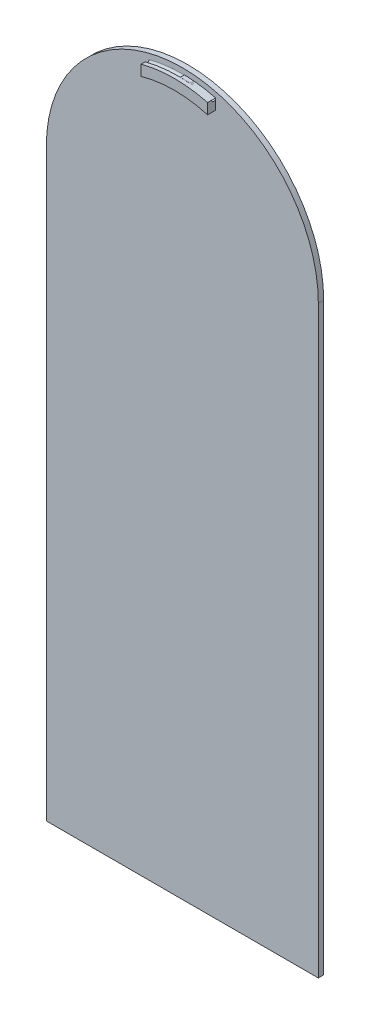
ISO-10303-21;
HEADER;
FILE_DESCRIPTION(('STEP AP214'),'2;1');
FILE_NAME('part.step','',(''),(''),'','','');
FILE_SCHEMA(('AUTOMOTIVE_DESIGN { 1 0 10303 214 1 1 1 1 }'));
ENDSEC;
DATA;
#1=APPLICATION_CONTEXT('core data for automotive mechanical design processes');
#2=APPLICATION_PROTOCOL_DEFINITION('international standard','automotive_design',2000,#1);
#3=PRODUCT_CONTEXT('',#1,'mechanical');
#4=PRODUCT('Part','Part','',(#3));
#5=PRODUCT_RELATED_PRODUCT_CATEGORY('part','',(#4));
#6=PRODUCT_DEFINITION_FORMATION('','',#4);
#7=PRODUCT_DEFINITION_CONTEXT('part definition',#1,'design');
#8=PRODUCT_DEFINITION('design','',#6,#7);
#9=PRODUCT_DEFINITION_SHAPE('','',#8);
#10=(LENGTH_UNIT() NAMED_UNIT(*) SI_UNIT(.MILLI.,.METRE.));
#11=(NAMED_UNIT(*) PLANE_ANGLE_UNIT() SI_UNIT($,.RADIAN.));
#12=(NAMED_UNIT(*) SI_UNIT($,.STERADIAN.) SOLID_ANGLE_UNIT());
#13=UNCERTAINTY_MEASURE_WITH_UNIT(LENGTH_MEASURE(1.E-05),#10,'distance_accuracy_value','');
#14=(GEOMETRIC_REPRESENTATION_CONTEXT(3) GLOBAL_UNCERTAINTY_ASSIGNED_CONTEXT((#13)) GLOBAL_UNIT_ASSIGNED_CONTEXT((#10,
#11,#12)) REPRESENTATION_CONTEXT('',''));
#15=CARTESIAN_POINT('',(0.,0.,0.));
#16=DIRECTION('',(0.,0.,1.));
#17=DIRECTION('',(1.,0.,0.));
#18=AXIS2_PLACEMENT_3D('',#15,#16,#17);
#19=CARTESIAN_POINT('',(0.,219.6,0.));
#20=DIRECTION('',(0.,0.,1.));
#21=DIRECTION('',(1.,0.,0.));
#22=AXIS2_PLACEMENT_3D('',#19,#20,#21);
#23=PLANE('',#22);
#24=CARTESIAN_POINT('',(0.,219.6,0.));
#25=DIRECTION('',(0.,0.,1.));
#26=DIRECTION('',(1.,0.,0.));
#27=AXIS2_PLACEMENT_3D('',#24,#25,#26);
#28=CIRCLE('',#27,51.1);
#29=CARTESIAN_POINT('',(51.1,219.6,0.));
#30=VERTEX_POINT('',#29);
#31=CARTESIAN_POINT('',(-51.1,219.6,0.));
#32=VERTEX_POINT('',#31);
#33=EDGE_CURVE('E486',#30,#32,#28,.T.);
#34=ORIENTED_EDGE('',*,*,#33,.T.);
#35=DIRECTION('',(0.,-1.,0.));
#36=VECTOR('',#35,1.);
#37=CARTESIAN_POINT('',(-51.1,219.6,0.));
#38=LINE('',#37,#36);
#39=CARTESIAN_POINT('',(-51.1,0.,0.));
#40=VERTEX_POINT('',#39);
#41=EDGE_CURVE('E479',#32,#40,#38,.T.);
#42=ORIENTED_EDGE('',*,*,#41,.T.);
#43=DIRECTION('',(1.,0.,0.));
#44=VECTOR('',#43,1.);
#45=CARTESIAN_POINT('',(-51.1,0.,0.));
#46=LINE('',#45,#44);
#47=CARTESIAN_POINT('',(51.1,0.,0.));
#48=VERTEX_POINT('',#47);
#49=EDGE_CURVE('E475',#40,#48,#46,.T.);
#50=ORIENTED_EDGE('',*,*,#49,.T.);
#51=DIRECTION('',(0.,1.,0.));
#52=VECTOR('',#51,1.);
#53=CARTESIAN_POINT('',(51.1,219.6,0.));
#54=LINE('',#53,#52);
#55=EDGE_CURVE('E467',#48,#30,#54,.T.);
#56=ORIENTED_EDGE('',*,*,#55,.T.);
#57=EDGE_LOOP('',(#34,#42,#50,#56));
#58=FACE_BOUND('',#57,.T.);
#59=DIRECTION('',(0.,1.,0.));
#60=VECTOR('',#59,1.);
#61=CARTESIAN_POINT('',(12.5,267.082207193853,0.));
#62=LINE('',#61,#60);
#63=CARTESIAN_POINT('',(12.5,263.082207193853,0.));
#64=VERTEX_POINT('',#63);
#65=CARTESIAN_POINT('',(12.5,267.080654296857,0.));
#66=VERTEX_POINT('',#65);
#67=EDGE_CURVE('E165',#64,#66,#62,.T.);
#68=ORIENTED_EDGE('',*,*,#67,.F.);
#69=CARTESIAN_POINT('',(0.,219.6,0.));
#70=DIRECTION('',(0.,0.,-1.));
#71=DIRECTION('',(-1.,0.,0.));
#72=AXIS2_PLACEMENT_3D('',#69,#70,#71);
#73=CIRCLE('',#72,45.2432574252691);
#74=CARTESIAN_POINT('',(-12.5,263.082207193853,0.));
#75=VERTEX_POINT('',#74);
#76=EDGE_CURVE('E166',#75,#64,#73,.T.);
#77=ORIENTED_EDGE('',*,*,#76,.F.);
#78=DIRECTION('',(0.,-1.,0.));
#79=VECTOR('',#78,1.);
#80=CARTESIAN_POINT('',(-12.5,267.082207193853,0.));
#81=LINE('',#80,#79);
#82=CARTESIAN_POINT('',(-12.5,267.082207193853,0.));
#83=VERTEX_POINT('',#82);
#84=EDGE_CURVE('E146',#83,#75,#81,.T.);
#85=ORIENTED_EDGE('',*,*,#84,.F.);
#86=CARTESIAN_POINT('',(13.885689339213,266.69765545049,0.));
#87=CARTESIAN_POINT('',(9.67257241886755,267.921243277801,-2.60801907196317E-12));
#88=CARTESIAN_POINT('',(5.22661873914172,268.625570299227,0.));
#89=CARTESIAN_POINT('',(-3.71976148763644,268.762867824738,0.));
#90=CARTESIAN_POINT('',(-8.21225986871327,268.210982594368,-1.64818926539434E-12));
#91=CARTESIAN_POINT('',(-12.8376519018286,266.993318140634,1.29791970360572E-13));
#92=CARTESIAN_POINT('',(-13.1779582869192,266.899832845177,-1.76420335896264E-13));
#93=CARTESIAN_POINT('',(-13.5145310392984,266.804264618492,0.));
#94=B_SPLINE_CURVE_WITH_KNOTS('',3,(#86,#87,#88,#89,#90,#91,#92,#93),.UNSPECIFIED.,.F.,.F.,(4,2,
2,4),(0.,0.481058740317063,0.962117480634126,1.),.UNSPECIFIED.);
#95=CARTESIAN_POINT('',(0.753019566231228,268.694225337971,0.));
#96=VERTEX_POINT('',#95);
#97=EDGE_CURVE('E111',#96,#83,#94,.T.);
#98=ORIENTED_EDGE('',*,*,#97,.F.);
#99=CARTESIAN_POINT('',(0.,219.6,0.));
#100=DIRECTION('',(0.,0.,1.));
#101=DIRECTION('',(-1.,0.,0.));
#102=AXIS2_PLACEMENT_3D('',#99,#100,#101);
#103=CIRCLE('',#102,49.1);
#104=EDGE_CURVE('E139',#66,#96,#103,.T.);
#105=ORIENTED_EDGE('',*,*,#104,.F.);
#106=EDGE_LOOP('',(#68,#77,#85,#98,#105));
#107=FACE_BOUND('',#106,.T.);
#108=ADVANCED_FACE('F33',(#58,#107),#23,.T.);
#109=CARTESIAN_POINT('',(0.,219.6,-2.));
#110=DIRECTION('',(0.,0.,1.));
#111=DIRECTION('',(1.,0.,0.));
#112=AXIS2_PLACEMENT_3D('',#109,#110,#111);
#113=CYLINDRICAL_SURFACE('',#112,51.1);
#114=ORIENTED_EDGE('',*,*,#33,.F.);
#115=DIRECTION('',(0.,0.,1.));
#116=VECTOR('',#115,1.);
#117=CARTESIAN_POINT('',(51.1,219.6,-2.));
#118=LINE('',#117,#116);
#119=CARTESIAN_POINT('',(51.1,219.6,-2.));
#120=VERTEX_POINT('',#119);
#121=EDGE_CURVE('E471',#120,#30,#118,.T.);
#122=ORIENTED_EDGE('',*,*,#121,.F.);
#123=CARTESIAN_POINT('',(0.,219.6,-2.));
#124=DIRECTION('',(0.,0.,1.));
#125=DIRECTION('',(1.,0.,0.));
#126=AXIS2_PLACEMENT_3D('',#123,#124,#125);
#127=CIRCLE('',#126,51.1);
#128=CARTESIAN_POINT('',(-51.1,219.6,-2.));
#129=VERTEX_POINT('',#128);
#130=EDGE_CURVE('E474',#120,#129,#127,.T.);
#131=ORIENTED_EDGE('',*,*,#130,.T.);
#132=DIRECTION('',(0.,0.,1.));
#133=VECTOR('',#132,1.);
#134=CARTESIAN_POINT('',(-51.1,219.6,-2.));
#135=LINE('',#134,#133);
#136=EDGE_CURVE('E155',#129,#32,#135,.T.);
#137=ORIENTED_EDGE('',*,*,#136,.T.);
#138=EDGE_LOOP('',(#114,#122,#131,#137));
#139=FACE_BOUND('',#138,.T.);
#140=ADVANCED_FACE('F293',(#139),#113,.T.);
#141=CARTESIAN_POINT('',(51.1,219.6,-2.));
#142=DIRECTION('',(1.,0.,0.));
#143=DIRECTION('',(0.,1.,0.));
#144=AXIS2_PLACEMENT_3D('',#141,#142,#143);
#145=PLANE('',#144);
#146=ORIENTED_EDGE('',*,*,#55,.F.);
#147=DIRECTION('',(0.,0.,1.));
#148=VECTOR('',#147,1.);
#149=CARTESIAN_POINT('',(51.1,0.,-2.));
#150=LINE('',#149,#148);
#151=CARTESIAN_POINT('',(51.1,0.,-2.));
#152=VERTEX_POINT('',#151);
#153=EDGE_CURVE('E469',#152,#48,#150,.T.);
#154=ORIENTED_EDGE('',*,*,#153,.F.);
#155=DIRECTION('',(0.,1.,0.));
#156=VECTOR('',#155,1.);
#157=CARTESIAN_POINT('',(51.1,219.6,-2.));
#158=LINE('',#157,#156);
#159=EDGE_CURVE('E488',#152,#120,#158,.T.);
#160=ORIENTED_EDGE('',*,*,#159,.T.);
#161=ORIENTED_EDGE('',*,*,#121,.T.);
#162=EDGE_LOOP('',(#146,#154,#160,#161));
#163=FACE_BOUND('',#162,.T.);
#164=ADVANCED_FACE('F299',(#163),#145,.T.);
#165=CARTESIAN_POINT('',(-51.1,0.,-2.));
#166=DIRECTION('',(0.,-1.,0.));
#167=DIRECTION('',(0.,0.,-1.));
#168=AXIS2_PLACEMENT_3D('',#165,#166,#167);
#169=PLANE('',#168);
#170=ORIENTED_EDGE('',*,*,#49,.F.);
#171=DIRECTION('',(0.,0.,1.));
#172=VECTOR('',#171,1.);
#173=CARTESIAN_POINT('',(-51.1,0.,-2.));
#174=LINE('',#173,#172);
#175=CARTESIAN_POINT('',(-51.1,0.,-2.));
#176=VERTEX_POINT('',#175);
#177=EDGE_CURVE('E169',#176,#40,#174,.T.);
#178=ORIENTED_EDGE('',*,*,#177,.F.);
#179=DIRECTION('',(1.,0.,0.));
#180=VECTOR('',#179,1.);
#181=CARTESIAN_POINT('',(-51.1,0.,-2.));
#182=LINE('',#181,#180);
#183=EDGE_CURVE('E490',#176,#152,#182,.T.);
#184=ORIENTED_EDGE('',*,*,#183,.T.);
#185=ORIENTED_EDGE('',*,*,#153,.T.);
#186=EDGE_LOOP('',(#170,#178,#184,#185));
#187=FACE_BOUND('',#186,.T.);
#188=ADVANCED_FACE('F434',(#187),#169,.T.);
#189=CARTESIAN_POINT('',(-51.1,219.6,-2.));
#190=DIRECTION('',(-1.,0.,0.));
#191=DIRECTION('',(0.,-1.,0.));
#192=AXIS2_PLACEMENT_3D('',#189,#190,#191);
#193=PLANE('',#192);
#194=ORIENTED_EDGE('',*,*,#41,.F.);
#195=ORIENTED_EDGE('',*,*,#136,.F.);
#196=DIRECTION('',(0.,-1.,0.));
#197=VECTOR('',#196,1.);
#198=CARTESIAN_POINT('',(-51.1,219.6,-2.));
#199=LINE('',#198,#197);
#200=EDGE_CURVE('E492',#129,#176,#199,.T.);
#201=ORIENTED_EDGE('',*,*,#200,.T.);
#202=ORIENTED_EDGE('',*,*,#177,.T.);
#203=EDGE_LOOP('',(#194,#195,#201,#202));
#204=FACE_BOUND('',#203,.T.);
#205=ADVANCED_FACE('F425',(#204),#193,.T.);
#206=CARTESIAN_POINT('',(0.,219.6,-2.));
#207=DIRECTION('',(0.,0.,1.));
#208=DIRECTION('',(1.,0.,0.));
#209=AXIS2_PLACEMENT_3D('',#206,#207,#208);
#210=PLANE('',#209);
#211=ORIENTED_EDGE('',*,*,#130,.F.);
#212=ORIENTED_EDGE('',*,*,#159,.F.);
#213=ORIENTED_EDGE('',*,*,#183,.F.);
#214=ORIENTED_EDGE('',*,*,#200,.F.);
#215=EDGE_LOOP('',(#211,#212,#213,#214));
#216=FACE_BOUND('',#215,.T.);
#217=ADVANCED_FACE('F308',(#216),#210,.F.);
#218=CARTESIAN_POINT('',(0.,219.6,3.));
#219=DIRECTION('',(0.,0.,-1.));
#220=DIRECTION('',(-1.,0.,0.));
#221=AXIS2_PLACEMENT_3D('',#218,#219,#220);
#222=CYLINDRICAL_SURFACE('',#221,45.2432574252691);
#223=ORIENTED_EDGE('',*,*,#76,.T.);
#224=DIRECTION('',(0.,0.,-1.));
#225=VECTOR('',#224,1.);
#226=CARTESIAN_POINT('',(12.5,263.082207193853,3.));
#227=LINE('',#226,#225);
#228=CARTESIAN_POINT('',(12.5,263.082207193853,3.));
#229=VERTEX_POINT('',#228);
#230=EDGE_CURVE('E323',#229,#64,#227,.T.);
#231=ORIENTED_EDGE('',*,*,#230,.F.);
#232=CARTESIAN_POINT('',(0.,219.6,3.));
#233=DIRECTION('',(0.,0.,-1.));
#234=DIRECTION('',(-1.,0.,0.));
#235=AXIS2_PLACEMENT_3D('',#232,#233,#234);
#236=CIRCLE('',#235,45.2432574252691);
#237=CARTESIAN_POINT('',(-12.5,263.082207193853,3.));
#238=VERTEX_POINT('',#237);
#239=EDGE_CURVE('E148',#238,#229,#236,.T.);
#240=ORIENTED_EDGE('',*,*,#239,.F.);
#241=DIRECTION('',(0.,0.,-1.));
#242=VECTOR('',#241,1.);
#243=CARTESIAN_POINT('',(-12.5,263.082207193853,3.));
#244=LINE('',#243,#242);
#245=EDGE_CURVE('E162',#238,#75,#244,.T.);
#246=ORIENTED_EDGE('',*,*,#245,.T.);
#247=EDGE_LOOP('',(#223,#231,#240,#246));
#248=FACE_BOUND('',#247,.T.);
#249=ADVANCED_FACE('F289',(#248),#222,.F.);
#250=CARTESIAN_POINT('',(12.5,267.082207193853,3.));
#251=DIRECTION('',(-1.,0.,0.));
#252=DIRECTION('',(0.,-1.,0.));
#253=AXIS2_PLACEMENT_3D('',#250,#251,#252);
#254=PLANE('',#253);
#255=ORIENTED_EDGE('',*,*,#67,.T.);
#256=CARTESIAN_POINT('',(12.5000000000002,267.079101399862,1.49999999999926));
#257=CARTESIAN_POINT('',(12.5000000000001,267.036963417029,1.500035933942));
#258=CARTESIAN_POINT('',(12.5,266.994836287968,1.49644578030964));
#259=CARTESIAN_POINT('',(12.5,266.911804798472,1.48227816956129));
#260=CARTESIAN_POINT('',(12.5,266.870899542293,1.47170596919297));
#261=CARTESIAN_POINT('',(12.5,266.791427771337,1.44383202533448));
#262=CARTESIAN_POINT('',(12.5,266.752862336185,1.42652720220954));
#263=CARTESIAN_POINT('',(12.5,266.679189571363,1.3856963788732));
#264=CARTESIAN_POINT('',(12.5,266.644081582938,1.3621715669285));
#265=CARTESIAN_POINT('',(12.5,266.578295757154,1.30955395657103));
#266=CARTESIAN_POINT('',(12.5,266.547619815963,1.28045878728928));
#267=CARTESIAN_POINT('',(12.5,266.491583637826,1.21753459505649));
#268=CARTESIAN_POINT('',(12.5,266.466223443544,1.18370553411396));
#269=CARTESIAN_POINT('',(12.5,266.421519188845,1.112247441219));
#270=CARTESIAN_POINT('',(12.5,266.402179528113,1.07461565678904));
#271=CARTESIAN_POINT('',(12.5,266.370088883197,0.996643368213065));
#272=CARTESIAN_POINT('',(12.5,266.357337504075,0.956303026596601));
#273=CARTESIAN_POINT('',(12.5,266.338774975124,0.874026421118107));
#274=CARTESIAN_POINT('',(12.5,266.332968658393,0.832089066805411));
#275=CARTESIAN_POINT('',(12.5,266.328476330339,0.747833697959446));
#276=CARTESIAN_POINT('',(12.5000000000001,266.329790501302,0.705515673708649));
#277=CARTESIAN_POINT('',(12.5000000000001,266.339504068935,0.621686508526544));
#278=CARTESIAN_POINT('',(12.5,266.347905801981,0.58017563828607));
#279=CARTESIAN_POINT('',(12.5,266.371560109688,0.499154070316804));
#280=CARTESIAN_POINT('',(12.5,266.386812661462,0.45964336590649));
#281=CARTESIAN_POINT('',(12.5,266.423734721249,0.383749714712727));
#282=CARTESIAN_POINT('',(12.5,266.445403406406,0.347366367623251));
#283=CARTESIAN_POINT('',(12.5,266.494543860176,0.278758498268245));
#284=CARTESIAN_POINT('',(12.5,266.522015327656,0.246533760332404));
#285=CARTESIAN_POINT('',(12.5,266.581966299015,0.187174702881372));
#286=CARTESIAN_POINT('',(12.5,266.614443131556,0.160037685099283));
#287=CARTESIAN_POINT('',(12.5,266.683495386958,0.111607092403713));
#288=CARTESIAN_POINT('',(12.5,266.720070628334,0.0903132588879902));
#289=CARTESIAN_POINT('',(12.5,266.796273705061,0.054174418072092));
#290=CARTESIAN_POINT('',(12.5,266.835901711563,0.0393297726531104));
#291=CARTESIAN_POINT('',(12.5,266.917057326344,0.0165311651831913));
#292=CARTESIAN_POINT('',(12.4999999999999,266.95858192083,0.00856664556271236));
#293=CARTESIAN_POINT('',(12.5,267.013502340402,0.00276191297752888));
#294=CARTESIAN_POINT('',(12.5,267.026612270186,0.00172564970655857));
#295=CARTESIAN_POINT('',(12.5,267.05284682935,0.000345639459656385));
#296=CARTESIAN_POINT('',(12.5,267.065971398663,7.51220619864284E-07));
#297=CARTESIAN_POINT('',(12.5000000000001,267.079101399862,-6.75285508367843E-13));
#298=B_SPLINE_CURVE_WITH_KNOTS('',3,(#256,#257,#258,#259,#260,#261,#262,#263,#264,#265,#266,
#267,#268,#269,#270,#271,#272,#273,#274,#275,#276,#277,#278,#279,#280,#281,#282,#283,#284,#285,
#286,#287,#288,#289,#290,#291,#292,#293,#294,#295,#296,#297),.UNSPECIFIED.,.F.,.F.,(4,2,2,2,2,2,
2,2,2,2,2,2,2,2,2,2,2,2,2,2,4),(0.,0.126245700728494,0.252396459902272,0.378604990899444,
0.504789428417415,0.631027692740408,0.757266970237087,0.883598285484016,1.00992202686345,
1.13633362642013,1.26274846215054,1.38920498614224,1.51566108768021,1.64210097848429,
1.76853430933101,1.89490039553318,2.02126088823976,2.14762847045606,2.27380179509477,
2.31324156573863,2.35261617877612),.UNSPECIFIED.);
#299=CARTESIAN_POINT('',(12.5,267.080654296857,1.49999999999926));
#300=VERTEX_POINT('',#299);
#301=EDGE_CURVE('E171',#300,#66,#298,.T.);
#302=ORIENTED_EDGE('',*,*,#301,.F.);
#303=DIRECTION('',(0.,0.,-1.));
#304=VECTOR('',#303,1.);
#305=CARTESIAN_POINT('',(12.5,267.082207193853,3.));
#306=LINE('',#305,#304);
#307=CARTESIAN_POINT('',(12.5,267.082207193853,3.));
#308=VERTEX_POINT('',#307);
#309=EDGE_CURVE('E138',#308,#300,#306,.T.);
#310=ORIENTED_EDGE('',*,*,#309,.F.);
#311=DIRECTION('',(0.,1.,0.));
#312=VECTOR('',#311,1.);
#313=CARTESIAN_POINT('',(12.5,267.082207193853,3.));
#314=LINE('',#313,#312);
#315=EDGE_CURVE('E174',#229,#308,#314,.T.);
#316=ORIENTED_EDGE('',*,*,#315,.F.);
#317=ORIENTED_EDGE('',*,*,#230,.T.);
#318=EDGE_LOOP('',(#255,#302,#310,#316,#317));
#319=FACE_BOUND('',#318,.T.);
#320=ADVANCED_FACE('F275',(#319),#254,.F.);
#321=CARTESIAN_POINT('',(0.,219.6,3.));
#322=DIRECTION('',(0.,0.,-1.));
#323=DIRECTION('',(-1.,0.,0.));
#324=AXIS2_PLACEMENT_3D('',#321,#322,#323);
#325=CYLINDRICAL_SURFACE('',#324,49.1);
#326=ORIENTED_EDGE('',*,*,#104,.T.);
#327=DIRECTION('',(0.,0.,-1.));
#328=VECTOR('',#327,1.);
#329=CARTESIAN_POINT('',(0.753019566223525,268.694225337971,0.750000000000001));
#330=LINE('',#329,#328);
#331=CARTESIAN_POINT('',(0.753019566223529,268.694225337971,1.5));
#332=VERTEX_POINT('',#331);
#333=EDGE_CURVE('E125',#332,#96,#330,.T.);
#334=ORIENTED_EDGE('',*,*,#333,.F.);
#335=CARTESIAN_POINT('',(13.885689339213,266.69765545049,1.5));
#336=CARTESIAN_POINT('',(9.67257241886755,267.921243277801,1.49999999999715));
#337=CARTESIAN_POINT('',(5.22661873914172,268.625570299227,1.5));
#338=CARTESIAN_POINT('',(-3.71976148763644,268.762867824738,1.5));
#339=CARTESIAN_POINT('',(-8.21225986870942,268.210982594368,1.49999999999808));
#340=CARTESIAN_POINT('',(-12.8376519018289,266.993318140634,1.50000000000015));
#341=CARTESIAN_POINT('',(-13.177958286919,266.899832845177,1.49999999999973));
#342=CARTESIAN_POINT('',(-13.5145310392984,266.804264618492,1.5));
#343=B_SPLINE_CURVE_WITH_KNOTS('',3,(#335,#336,#337,#338,#339,#340,#341,#342),.UNSPECIFIED.,.F.,
.F.,(4,2,2,4),(0.,0.481058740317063,0.962117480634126,1.),.UNSPECIFIED.);
#344=CARTESIAN_POINT('',(-12.5,267.082207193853,1.5));
#345=VERTEX_POINT('',#344);
#346=EDGE_CURVE('E120',#332,#345,#343,.T.);
#347=ORIENTED_EDGE('',*,*,#346,.T.);
#348=DIRECTION('',(0.,0.,-1.));
#349=VECTOR('',#348,1.);
#350=CARTESIAN_POINT('',(-12.5,267.082207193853,3.));
#351=LINE('',#350,#349);
#352=CARTESIAN_POINT('',(-12.5,267.082207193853,3.));
#353=VERTEX_POINT('',#352);
#354=EDGE_CURVE('E136',#353,#345,#351,.T.);
#355=ORIENTED_EDGE('',*,*,#354,.F.);
#356=CARTESIAN_POINT('',(0.,219.6,3.));
#357=DIRECTION('',(0.,0.,1.));
#358=DIRECTION('',(-1.,0.,0.));
#359=AXIS2_PLACEMENT_3D('',#356,#357,#358);
#360=CIRCLE('',#359,49.1);
#361=EDGE_CURVE('E172',#308,#353,#360,.T.);
#362=ORIENTED_EDGE('',*,*,#361,.F.);
#363=ORIENTED_EDGE('',*,*,#309,.T.);
#364=DIRECTION('',(0.,0.,-1.));
#365=VECTOR('',#364,1.);
#366=CARTESIAN_POINT('',(12.5,267.079101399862,0.749999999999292));
#367=LINE('',#366,#365);
#368=EDGE_CURVE('E46',#66,#300,#367,.F.);
#369=ORIENTED_EDGE('',*,*,#368,.F.);
#370=EDGE_LOOP('',(#326,#334,#347,#355,#362,#363,#369));
#371=FACE_BOUND('',#370,.T.);
#372=ADVANCED_FACE('F134',(#371),#325,.T.);
#373=CARTESIAN_POINT('',(-12.5,267.082207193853,3.));
#374=DIRECTION('',(1.,0.,0.));
#375=DIRECTION('',(0.,0.,-1.));
#376=AXIS2_PLACEMENT_3D('',#373,#374,#375);
#377=PLANE('',#376);
#378=ORIENTED_EDGE('',*,*,#354,.T.);
#379=CARTESIAN_POINT('',(-12.5000000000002,267.082207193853,0.));
#380=CARTESIAN_POINT('',(-12.5000000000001,267.040014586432,-3.58286316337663E-05));
#381=CARTESIAN_POINT('',(-12.5,266.997832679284,0.00355829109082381));
#382=CARTESIAN_POINT('',(-12.5,266.914692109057,0.0177423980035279));
#383=CARTESIAN_POINT('',(-12.5,266.873732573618,0.0283272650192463));
#384=CARTESIAN_POINT('',(-12.5,266.794154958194,0.0562360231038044));
#385=CARTESIAN_POINT('',(-12.5,266.755537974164,0.0735630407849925));
#386=CARTESIAN_POINT('',(-12.5,266.681768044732,0.11444861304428));
#387=CARTESIAN_POINT('',(-12.5,266.64661442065,0.138005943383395));
#388=CARTESIAN_POINT('',(-12.5,266.580757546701,0.190690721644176));
#389=CARTESIAN_POINT('',(-12.5,266.550054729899,0.219818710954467));
#390=CARTESIAN_POINT('',(-12.5,266.493974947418,0.282815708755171));
#391=CARTESIAN_POINT('',(-12.5,266.468597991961,0.316684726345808));
#392=CARTESIAN_POINT('',(-12.5,266.423889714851,0.388203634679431));
#393=CARTESIAN_POINT('',(-12.5,266.404558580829,0.425853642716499));
#394=CARTESIAN_POINT('',(-12.5,266.372492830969,0.503862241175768));
#395=CARTESIAN_POINT('',(-12.5,266.35975779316,0.544220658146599));
#396=CARTESIAN_POINT('',(-12.5,266.341243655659,0.626503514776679));
#397=CARTESIAN_POINT('',(-12.5,266.335464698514,0.668427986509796));
#398=CARTESIAN_POINT('',(-12.5,266.331027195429,0.752653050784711));
#399=CARTESIAN_POINT('',(-12.5,266.332368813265,0.794953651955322));
#400=CARTESIAN_POINT('',(-12.5,266.342134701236,0.878728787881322));
#401=CARTESIAN_POINT('',(-12.5,266.350558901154,0.920203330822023));
#402=CARTESIAN_POINT('',(-12.5,266.374250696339,1.00114931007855));
#403=CARTESIAN_POINT('',(-12.5,266.389518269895,1.04062075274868));
#404=CARTESIAN_POINT('',(-12.5,266.426463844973,1.1164411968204));
#405=CARTESIAN_POINT('',(-12.5,266.448142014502,1.15279011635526));
#406=CARTESIAN_POINT('',(-12.5,266.497292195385,1.22133077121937));
#407=CARTESIAN_POINT('',(-12.5,266.524763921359,1.25352271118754));
#408=CARTESIAN_POINT('',(-12.5,266.584722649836,1.31283900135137));
#409=CARTESIAN_POINT('',(-12.5,266.617209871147,1.33996313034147));
#410=CARTESIAN_POINT('',(-12.5,266.686277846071,1.38837121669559));
#411=CARTESIAN_POINT('',(-12.5,266.722858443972,1.40965539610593));
#412=CARTESIAN_POINT('',(-12.5,266.799095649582,1.44579463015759));
#413=CARTESIAN_POINT('',(-12.5,266.838754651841,1.46064461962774));
#414=CARTESIAN_POINT('',(-12.5,266.919971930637,1.4834528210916));
#415=CARTESIAN_POINT('',(-12.5,266.961527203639,1.491421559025));
#416=CARTESIAN_POINT('',(-12.5,267.016499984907,1.49723298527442));
#417=CARTESIAN_POINT('',(-12.5,267.029631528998,1.49827116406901));
#418=CARTESIAN_POINT('',(-12.5,267.055909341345,1.49965372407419));
#419=CARTESIAN_POINT('',(-12.5,267.069055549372,1.49999924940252));
#420=CARTESIAN_POINT('',(-12.5,267.082207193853,1.5));
#421=B_SPLINE_CURVE_WITH_KNOTS('',3,(#379,#380,#381,#382,#383,#384,#385,#386,#387,#388,#389,
#390,#391,#392,#393,#394,#395,#396,#397,#398,#399,#400,#401,#402,#403,#404,#405,#406,#407,#408,
#409,#410,#411,#412,#413,#414,#415,#416,#417,#418,#419,#420),.UNSPECIFIED.,.F.,.F.,(4,2,2,2,2,2,
2,2,2,2,2,2,2,2,2,2,2,2,2,2,4),(0.,0.126409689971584,0.252726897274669,0.379102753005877,
0.505453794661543,0.631817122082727,0.758180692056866,0.884548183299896,1.01090758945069,
1.13726958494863,1.26363448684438,1.38999813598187,1.51636138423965,1.64272794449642,
1.7690882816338,1.89545413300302,2.02181517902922,2.14827552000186,2.27454207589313,
2.31404690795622,2.35348643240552),.UNSPECIFIED.);
#422=EDGE_CURVE('E115',#83,#345,#421,.T.);
#423=ORIENTED_EDGE('',*,*,#422,.F.);
#424=ORIENTED_EDGE('',*,*,#84,.T.);
#425=ORIENTED_EDGE('',*,*,#245,.F.);
#426=DIRECTION('',(0.,-1.,0.));
#427=VECTOR('',#426,1.);
#428=CARTESIAN_POINT('',(-12.5,267.082207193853,3.));
#429=LINE('',#428,#427);
#430=EDGE_CURVE('E145',#353,#238,#429,.T.);
#431=ORIENTED_EDGE('',*,*,#430,.F.);
#432=EDGE_LOOP('',(#378,#423,#424,#425,#431));
#433=FACE_BOUND('',#432,.T.);
#434=ADVANCED_FACE('F143',(#433),#377,.F.);
#435=CARTESIAN_POINT('',(0.,219.6,3.));
#436=DIRECTION('',(0.,0.,-1.));
#437=DIRECTION('',(-1.,0.,0.));
#438=AXIS2_PLACEMENT_3D('',#435,#436,#437);
#439=PLANE('',#438);
#440=ORIENTED_EDGE('',*,*,#239,.T.);
#441=ORIENTED_EDGE('',*,*,#315,.T.);
#442=ORIENTED_EDGE('',*,*,#361,.T.);
#443=ORIENTED_EDGE('',*,*,#430,.T.);
#444=EDGE_LOOP('',(#440,#441,#442,#443));
#445=FACE_BOUND('',#444,.T.);
#446=ADVANCED_FACE('F198',(#445),#439,.F.);
#447=CARTESIAN_POINT('',(13.885689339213,266.69765545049,0.));
#448=CARTESIAN_POINT('',(9.67257241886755,267.921243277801,-2.60801907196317E-12));
#449=CARTESIAN_POINT('',(5.22661873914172,268.625570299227,0.));
#450=CARTESIAN_POINT('',(-3.71976148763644,268.762867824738,0.));
#451=CARTESIAN_POINT('',(-8.21225986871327,268.210982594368,-1.64818926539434E-12));
#452=CARTESIAN_POINT('',(-12.8376519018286,266.993318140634,1.29791970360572E-13));
#453=CARTESIAN_POINT('',(-13.1779582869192,266.899832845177,-1.76420335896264E-13));
#454=CARTESIAN_POINT('',(-13.5145310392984,266.804264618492,0.));
#455=CARTESIAN_POINT('',(13.1144031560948,265.411141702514,0.));
#456=CARTESIAN_POINT('',(9.01008838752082,266.56906357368,-2.52738944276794E-12));
#457=CARTESIAN_POINT('',(4.687261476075,267.218863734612,0.));
#458=CARTESIAN_POINT('',(-3.98857930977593,267.28048231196,0.));
#459=CARTESIAN_POINT('',(-8.34958178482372,266.710982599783,-9.2772321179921E-13));
#460=CARTESIAN_POINT('',(-12.8268380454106,265.493318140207,0.));
#461=CARTESIAN_POINT('',(-13.1577491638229,265.399938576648,-1.77609823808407E-13));
#462=CARTESIAN_POINT('',(-13.4856617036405,265.304542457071,0.));
#463=CARTESIAN_POINT('',(13.1144031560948,265.411141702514,1.5));
#464=CARTESIAN_POINT('',(9.01008838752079,266.56906357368,1.49999999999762));
#465=CARTESIAN_POINT('',(4.687261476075,267.218863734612,1.5));
#466=CARTESIAN_POINT('',(-3.98857930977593,267.28048231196,1.5));
#467=CARTESIAN_POINT('',(-8.34958178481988,266.710982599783,1.49999999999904));
#468=CARTESIAN_POINT('',(-12.8268380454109,265.493318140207,1.50000000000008));
#469=CARTESIAN_POINT('',(-13.1577491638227,265.399938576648,1.49999999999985));
#470=CARTESIAN_POINT('',(-13.4856617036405,265.304542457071,1.5));
#471=CARTESIAN_POINT('',(13.885689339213,266.69765545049,1.5));
#472=CARTESIAN_POINT('',(9.67257241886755,267.921243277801,1.49999999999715));
#473=CARTESIAN_POINT('',(5.22661873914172,268.625570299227,1.5));
#474=CARTESIAN_POINT('',(-3.71976148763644,268.762867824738,1.5));
#475=CARTESIAN_POINT('',(-8.21225986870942,268.210982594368,1.49999999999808));
#476=CARTESIAN_POINT('',(-12.8376519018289,266.993318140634,1.50000000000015));
#477=CARTESIAN_POINT('',(-13.177958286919,266.899832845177,1.49999999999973));
#478=CARTESIAN_POINT('',(-13.5145310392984,266.804264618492,1.5));
#479=(BOUNDED_SURFACE() B_SPLINE_SURFACE(3,3,((#447,#448,#449,#450,#451,#452,#453,#454),(#455,
#456,#457,#458,#459,#460,#461,#462),(#463,#464,#465,#466,#467,#468,#469,#470),(#471,#472,#473,
#474,#475,#476,#477,#478)),.UNSPECIFIED.,.F.,.F.,.F.) B_SPLINE_SURFACE_WITH_KNOTS((4,4),(4,2,2,
4),(0.,1.),(0.,0.481058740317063,0.962117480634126,1.),
.UNSPECIFIED.) GEOMETRIC_REPRESENTATION_ITEM() RATIONAL_B_SPLINE_SURFACE(((1.,1.,1.,1.,1.,1.,1.,
1.),(0.333333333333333,0.333333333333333,0.333333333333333,0.333333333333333,0.333333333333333,
0.333333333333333,0.333333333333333,0.333333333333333),(0.333333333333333,0.333333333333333,
0.333333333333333,0.333333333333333,0.333333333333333,0.333333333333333,0.333333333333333,
0.333333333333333),(1.,1.,1.,1.,1.,1.,1.,1.))) REPRESENTATION_ITEM('') SURFACE());
#480=EDGE_CURVE('E254',#66,#96,#94,.T.);
#481=EDGE_CURVE('E11',#300,#332,#343,.T.);
#482=CARTESIAN_POINT('',(13.8866920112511,266.699327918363,0.));
#483=CARTESIAN_POINT('',(9.6734336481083,267.923001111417,-2.60812389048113E-12));
#484=CARTESIAN_POINT('',(5.22731990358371,268.627399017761,0.));
#485=CARTESIAN_POINT('',(-3.71941202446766,268.764794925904,0.));
#486=CARTESIAN_POINT('',(-8.21208135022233,268.212932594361,-1.64912587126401E-12));
#487=CARTESIAN_POINT('',(-12.8376659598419,266.995268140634,1.29865984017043E-13));
#488=CARTESIAN_POINT('',(-13.1779845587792,266.901782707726,-1.76418789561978E-13));
#489=CARTESIAN_POINT('',(-13.5145685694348,266.806214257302,0.));
#490=CARTESIAN_POINT('',(13.8863577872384,266.698770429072,0.));
#491=CARTESIAN_POINT('',(9.67314657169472,267.922415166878,-2.60808895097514E-12));
#492=CARTESIAN_POINT('',(5.22708618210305,268.626789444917,0.));
#493=CARTESIAN_POINT('',(-3.71952851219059,268.764152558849,0.));
#494=CARTESIAN_POINT('',(-8.21214085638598,268.212282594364,-1.64881366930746E-12));
#495=CARTESIAN_POINT('',(-12.8376612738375,266.994618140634,1.29841312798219E-13));
#496=CARTESIAN_POINT('',(-13.1779758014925,266.901132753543,-1.7641930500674E-13));
#497=CARTESIAN_POINT('',(-13.5145560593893,266.805564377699,0.));
#498=CARTESIAN_POINT('',(13.8860235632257,266.698212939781,0.));
#499=CARTESIAN_POINT('',(9.67285949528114,267.92182922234,-2.60805401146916E-12));
#500=CARTESIAN_POINT('',(5.22685246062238,268.626179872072,0.));
#501=CARTESIAN_POINT('',(-3.71964499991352,268.763510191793,0.));
#502=CARTESIAN_POINT('',(-8.21220036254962,268.211632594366,-1.6485014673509E-12));
#503=CARTESIAN_POINT('',(-12.837656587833,266.993968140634,1.29816641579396E-13));
#504=CARTESIAN_POINT('',(-13.1779670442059,266.90048279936,-1.76419820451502E-13));
#505=CARTESIAN_POINT('',(-13.5145435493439,266.804914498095,0.));
#506=CARTESIAN_POINT('',(13.885689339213,266.69765545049,0.));
#507=CARTESIAN_POINT('',(9.67257241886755,267.921243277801,-2.60801907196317E-12));
#508=CARTESIAN_POINT('',(5.22661873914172,268.625570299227,0.));
#509=CARTESIAN_POINT('',(-3.71976148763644,268.762867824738,0.));
#510=CARTESIAN_POINT('',(-8.21225986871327,268.210982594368,-1.64818926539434E-12));
#511=CARTESIAN_POINT('',(-12.8376519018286,266.993318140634,1.29791970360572E-13));
#512=CARTESIAN_POINT('',(-13.1779582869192,266.899832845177,-1.76420335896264E-13));
#513=CARTESIAN_POINT('',(-13.5145310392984,266.804264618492,0.));
#514=CARTESIAN_POINT('',(13.1144031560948,265.411141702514,0.));
#515=CARTESIAN_POINT('',(9.01008838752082,266.56906357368,-2.52738944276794E-12));
#516=CARTESIAN_POINT('',(4.687261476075,267.218863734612,0.));
#517=CARTESIAN_POINT('',(-3.98857930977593,267.28048231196,0.));
#518=CARTESIAN_POINT('',(-8.34958178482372,266.710982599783,-9.2772321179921E-13));
#519=CARTESIAN_POINT('',(-12.8268380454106,265.493318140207,0.));
#520=CARTESIAN_POINT('',(-13.1577491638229,265.399938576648,-1.77609823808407E-13));
#521=CARTESIAN_POINT('',(-13.4856617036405,265.304542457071,0.));
#522=CARTESIAN_POINT('',(13.1144031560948,265.411141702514,1.5));
#523=CARTESIAN_POINT('',(9.01008838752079,266.56906357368,1.49999999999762));
#524=CARTESIAN_POINT('',(4.687261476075,267.218863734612,1.5));
#525=CARTESIAN_POINT('',(-3.98857930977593,267.28048231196,1.5));
#526=CARTESIAN_POINT('',(-8.34958178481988,266.710982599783,1.49999999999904));
#527=CARTESIAN_POINT('',(-12.8268380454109,265.493318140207,1.50000000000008));
#528=CARTESIAN_POINT('',(-13.1577491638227,265.399938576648,1.49999999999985));
#529=CARTESIAN_POINT('',(-13.4856617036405,265.304542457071,1.5));
#530=CARTESIAN_POINT('',(13.885689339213,266.69765545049,1.5));
#531=CARTESIAN_POINT('',(9.67257241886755,267.921243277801,1.49999999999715));
#532=CARTESIAN_POINT('',(5.22661873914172,268.625570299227,1.5));
#533=CARTESIAN_POINT('',(-3.71976148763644,268.762867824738,1.5));
#534=CARTESIAN_POINT('',(-8.21225986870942,268.210982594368,1.49999999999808));
#535=CARTESIAN_POINT('',(-12.8376519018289,266.993318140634,1.50000000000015));
#536=CARTESIAN_POINT('',(-13.177958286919,266.899832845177,1.49999999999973));
#537=CARTESIAN_POINT('',(-13.5145310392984,266.804264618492,1.5));
#538=CARTESIAN_POINT('',(13.8860235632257,266.698212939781,1.5));
#539=CARTESIAN_POINT('',(9.67285949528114,267.92182922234,1.49999999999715));
#540=CARTESIAN_POINT('',(5.22685246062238,268.626179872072,1.5));
#541=CARTESIAN_POINT('',(-3.71964499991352,268.763510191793,1.5));
#542=CARTESIAN_POINT('',(-8.21220036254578,268.211632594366,1.49999999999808));
#543=CARTESIAN_POINT('',(-12.8376565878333,266.993968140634,1.50000000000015));
#544=CARTESIAN_POINT('',(-13.1779670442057,266.90048279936,1.49999999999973));
#545=CARTESIAN_POINT('',(-13.5145435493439,266.804914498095,1.5));
#546=CARTESIAN_POINT('',(13.8863577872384,266.698770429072,1.5));
#547=CARTESIAN_POINT('',(9.67314657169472,267.922415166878,1.49999999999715));
#548=CARTESIAN_POINT('',(5.22708618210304,268.626789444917,1.5));
#549=CARTESIAN_POINT('',(-3.71952851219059,268.764152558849,1.5));
#550=CARTESIAN_POINT('',(-8.21214085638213,268.212282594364,1.49999999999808));
#551=CARTESIAN_POINT('',(-12.8376612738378,266.994618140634,1.50000000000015));
#552=CARTESIAN_POINT('',(-13.1779758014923,266.901132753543,1.49999999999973));
#553=CARTESIAN_POINT('',(-13.5145560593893,266.805564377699,1.5));
#554=CARTESIAN_POINT('',(13.8866920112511,266.699327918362,1.5));
#555=CARTESIAN_POINT('',(9.6734336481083,267.923001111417,1.49999999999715));
#556=CARTESIAN_POINT('',(5.22731990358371,268.627399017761,1.5));
#557=CARTESIAN_POINT('',(-3.71941202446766,268.764794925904,1.5));
#558=CARTESIAN_POINT('',(-8.21208135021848,268.212932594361,1.49999999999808));
#559=CARTESIAN_POINT('',(-12.8376659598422,266.995268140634,1.50000000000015));
#560=CARTESIAN_POINT('',(-13.177984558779,266.901782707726,1.49999999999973));
#561=CARTESIAN_POINT('',(-13.5145685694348,266.806214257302,1.5));
#562=(BOUNDED_SURFACE() B_SPLINE_SURFACE(3,3,((#482,#483,#484,#485,#486,#487,#488,#489),(#490,
#491,#492,#493,#494,#495,#496,#497),(#498,#499,#500,#501,#502,#503,#504,#505),(#506,#507,#508,
#509,#510,#511,#512,#513),(#514,#515,#516,#517,#518,#519,#520,#521),(#522,#523,#524,#525,#526,
#527,#528,#529),(#530,#531,#532,#533,#534,#535,#536,#537),(#538,#539,#540,#541,#542,#543,#544,
#545),(#546,#547,#548,#549,#550,#551,#552,#553),(#554,#555,#556,#557,#558,#559,#560,#561)),
.UNSPECIFIED.,.F.,.F.,.F.) B_SPLINE_SURFACE_WITH_KNOTS((4,3,3,4),(4,2,2,4),(-2.0117,-2.,25.,
25.1056663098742),(0.,0.481058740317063,0.962117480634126,1.),
.UNSPECIFIED.) GEOMETRIC_REPRESENTATION_ITEM() RATIONAL_B_SPLINE_SURFACE(((27.,27.,27.,27.,27.,
27.,27.,27.),(27.,27.,27.,27.,27.,27.,27.,27.),(27.,27.,27.,27.,27.,27.,27.,27.),(27.,27.,27.,
27.,27.,27.,27.,27.),(27.,27.,27.,27.,27.,27.,27.,27.),(80.9999999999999,80.9999999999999,
80.9999999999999,80.9999999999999,80.9999999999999,80.9999999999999,80.9999999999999,
80.9999999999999),(728.999999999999,728.999999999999,728.999999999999,728.999999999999,
728.999999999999,728.999999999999,728.999999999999,728.999999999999),(731.535991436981,
731.535991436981,731.535991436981,731.535991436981,731.535991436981,731.535991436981,
731.535991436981,731.535991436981),(734.080804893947,734.080804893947,734.080804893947,
734.080804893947,734.080804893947,734.080804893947,734.080804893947,734.080804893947),
(736.63447106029,736.63447106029,736.63447106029,736.63447106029,736.63447106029,
736.63447106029,736.63447106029,736.63447106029))) REPRESENTATION_ITEM('') SURFACE());
#563=ORIENTED_EDGE('',*,*,#301,.T.);
#564=ORIENTED_EDGE('',*,*,#480,.T.);
#565=ORIENTED_EDGE('',*,*,#97,.T.);
#566=ORIENTED_EDGE('',*,*,#422,.T.);
#567=ORIENTED_EDGE('',*,*,#346,.F.);
#568=ORIENTED_EDGE('',*,*,#481,.F.);
#569=EDGE_LOOP('',(#563,#564,#565,#566,#567,#568));
#570=FACE_BOUND('',#569,.T.);
#571=ADVANCED_FACE('F119',(#570),#562,.F.);
#572=CARTESIAN_POINT('',(13.885689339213,266.69765545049,1.5));
#573=CARTESIAN_POINT('',(9.67257241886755,267.921243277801,1.49999999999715));
#574=CARTESIAN_POINT('',(5.22661873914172,268.625570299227,1.5));
#575=CARTESIAN_POINT('',(-3.71976148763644,268.762867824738,1.5));
#576=CARTESIAN_POINT('',(-8.21225986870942,268.210982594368,1.49999999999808));
#577=CARTESIAN_POINT('',(-12.8376519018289,266.993318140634,1.50000000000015));
#578=CARTESIAN_POINT('',(-13.177958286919,266.899832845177,1.49999999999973));
#579=CARTESIAN_POINT('',(-13.5145310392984,266.804264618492,1.5));
#580=CARTESIAN_POINT('',(13.885689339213,266.69765545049,0.));
#581=CARTESIAN_POINT('',(9.67257241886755,267.921243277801,-2.60801907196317E-12));
#582=CARTESIAN_POINT('',(5.22661873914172,268.625570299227,0.));
#583=CARTESIAN_POINT('',(-3.71976148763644,268.762867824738,0.));
#584=CARTESIAN_POINT('',(-8.21225986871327,268.210982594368,-1.64818926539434E-12));
#585=CARTESIAN_POINT('',(-12.8376519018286,266.993318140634,1.29791970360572E-13));
#586=CARTESIAN_POINT('',(-13.1779582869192,266.899832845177,-1.76420335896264E-13));
#587=CARTESIAN_POINT('',(-13.5145310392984,266.804264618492,0.));
#588=B_SPLINE_SURFACE_WITH_KNOTS('',1,3,((#572,#573,#574,#575,#576,#577,#578,#579),(#580,#581,
#582,#583,#584,#585,#586,#587)),.UNSPECIFIED.,.F.,.F.,.F.,(2,2),(4,2,2,4),(0.,1.),(0.,
0.481058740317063,0.962117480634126,1.),.UNSPECIFIED.);
#589=ORIENTED_EDGE('',*,*,#333,.T.);
#590=ORIENTED_EDGE('',*,*,#480,.F.);
#591=ORIENTED_EDGE('',*,*,#368,.T.);
#592=ORIENTED_EDGE('',*,*,#481,.T.);
#593=EDGE_LOOP('',(#589,#590,#591,#592));
#594=FACE_BOUND('',#593,.T.);
#595=ADVANCED_FACE('F35',(#594),#588,.F.);
#596=CLOSED_SHELL('',(#108,#140,#164,#188,#205,#217,#249,#320,#372,#434,#446,#571,#595));
#597=MANIFOLD_SOLID_BREP('B2',#596);
#598=ADVANCED_BREP_SHAPE_REPRESENTATION('',(#18,#597),#14);
#599=SHAPE_DEFINITION_REPRESENTATION(#9,#598);
ENDSEC;
END-ISO-10303-21;
